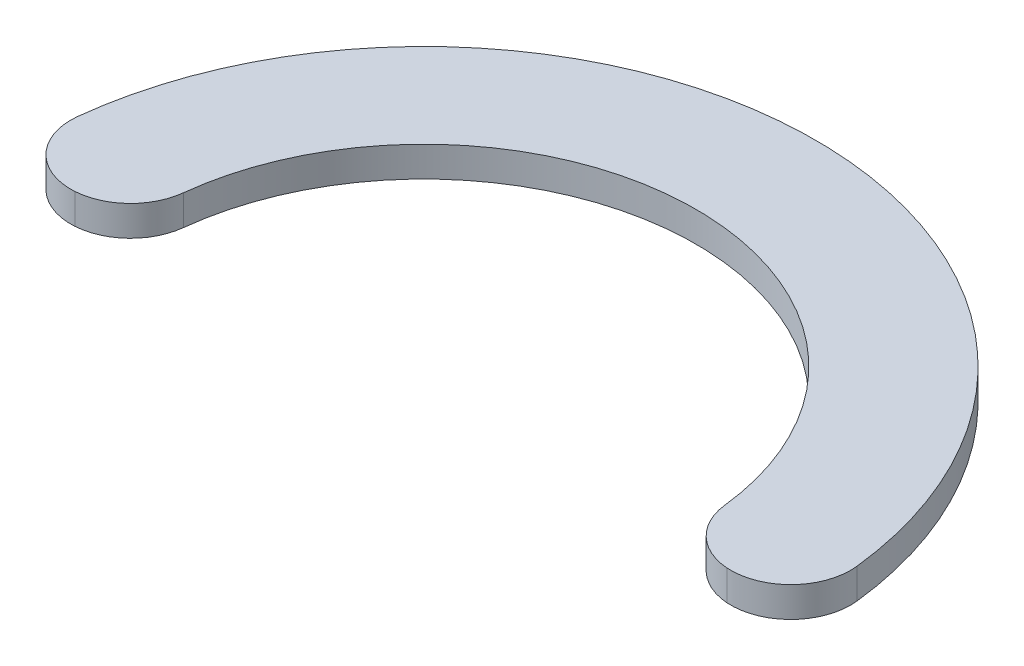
ISO-10303-21;
HEADER;
FILE_DESCRIPTION(('STEP AP214'),'2;1');
FILE_NAME('part.step','',(''),(''),'','','');
FILE_SCHEMA(('AUTOMOTIVE_DESIGN { 1 0 10303 214 1 1 1 1 }'));
ENDSEC;
DATA;
#1=APPLICATION_CONTEXT('core data for automotive mechanical design processes');
#2=APPLICATION_PROTOCOL_DEFINITION('international standard','automotive_design',2000,#1);
#3=PRODUCT_CONTEXT('',#1,'mechanical');
#4=PRODUCT('Part','Part','',(#3));
#5=PRODUCT_RELATED_PRODUCT_CATEGORY('part','',(#4));
#6=PRODUCT_DEFINITION_FORMATION('','',#4);
#7=PRODUCT_DEFINITION_CONTEXT('part definition',#1,'design');
#8=PRODUCT_DEFINITION('design','',#6,#7);
#9=PRODUCT_DEFINITION_SHAPE('','',#8);
#10=(LENGTH_UNIT() NAMED_UNIT(*) SI_UNIT(.MILLI.,.METRE.));
#11=(NAMED_UNIT(*) PLANE_ANGLE_UNIT() SI_UNIT($,.RADIAN.));
#12=(NAMED_UNIT(*) SI_UNIT($,.STERADIAN.) SOLID_ANGLE_UNIT());
#13=UNCERTAINTY_MEASURE_WITH_UNIT(LENGTH_MEASURE(1.E-05),#10,'distance_accuracy_value','');
#14=(GEOMETRIC_REPRESENTATION_CONTEXT(3) GLOBAL_UNCERTAINTY_ASSIGNED_CONTEXT((#13)) GLOBAL_UNIT_ASSIGNED_CONTEXT((#10,
#11,#12)) REPRESENTATION_CONTEXT('',''));
#15=CARTESIAN_POINT('',(0.,0.,0.));
#16=DIRECTION('',(0.,0.,1.));
#17=DIRECTION('',(1.,0.,0.));
#18=AXIS2_PLACEMENT_3D('',#15,#16,#17);
#19=CARTESIAN_POINT('',(0.,4.,0.));
#20=DIRECTION('',(0.,-1.,0.));
#21=DIRECTION('',(0.,0.,-1.));
#22=AXIS2_PLACEMENT_3D('',#19,#20,#21);
#23=CYLINDRICAL_SURFACE('',#22,36.075);
#24=CARTESIAN_POINT('',(0.,0.,0.));
#25=DIRECTION('',(0.,1.,0.));
#26=DIRECTION('',(1.,0.,0.));
#27=AXIS2_PLACEMENT_3D('',#24,#25,#26);
#28=CIRCLE('',#27,36.075);
#29=CARTESIAN_POINT('',(-35.8508829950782,0.,-4.0149487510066));
#30=VERTEX_POINT('',#29);
#31=CARTESIAN_POINT('',(35.8508829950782,0.,-4.01494875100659));
#32=VERTEX_POINT('',#31);
#33=EDGE_CURVE('E107',#30,#32,#28,.F.);
#34=ORIENTED_EDGE('',*,*,#33,.T.);
#35=DIRECTION('',(0.,-1.,0.));
#36=VECTOR('',#35,1.);
#37=CARTESIAN_POINT('',(35.8508829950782,4.,-4.01494875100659));
#38=LINE('',#37,#36);
#39=CARTESIAN_POINT('',(35.8508829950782,4.,-4.01494875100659));
#40=VERTEX_POINT('',#39);
#41=EDGE_CURVE('E11',#32,#40,#38,.F.);
#42=ORIENTED_EDGE('',*,*,#41,.T.);
#43=CARTESIAN_POINT('',(0.,4.,0.));
#44=DIRECTION('',(0.,1.,0.));
#45=DIRECTION('',(1.,0.,0.));
#46=AXIS2_PLACEMENT_3D('',#43,#44,#45);
#47=CIRCLE('',#46,36.075);
#48=CARTESIAN_POINT('',(-35.8508829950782,4.,-4.0149487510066));
#49=VERTEX_POINT('',#48);
#50=EDGE_CURVE('E106',#49,#40,#47,.F.);
#51=ORIENTED_EDGE('',*,*,#50,.F.);
#52=DIRECTION('',(0.,-1.,0.));
#53=VECTOR('',#52,1.);
#54=CARTESIAN_POINT('',(-35.8508829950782,4.,-4.0149487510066));
#55=LINE('',#54,#53);
#56=EDGE_CURVE('E40',#49,#30,#55,.T.);
#57=ORIENTED_EDGE('',*,*,#56,.T.);
#58=EDGE_LOOP('',(#34,#42,#51,#57));
#59=FACE_BOUND('',#58,.T.);
#60=ADVANCED_FACE('F31',(#59),#23,.F.);
#61=CARTESIAN_POINT('',(0.,4.,0.));
#62=DIRECTION('',(0.,-1.,0.));
#63=DIRECTION('',(0.,0.,-1.));
#64=AXIS2_PLACEMENT_3D('',#61,#62,#63);
#65=CYLINDRICAL_SURFACE('',#64,51.925);
#66=CARTESIAN_POINT('',(0.,4.,0.));
#67=DIRECTION('',(0.,1.,0.));
#68=DIRECTION('',(1.,0.,0.));
#69=AXIS2_PLACEMENT_3D('',#66,#67,#68);
#70=CIRCLE('',#69,51.925);
#71=CARTESIAN_POINT('',(-51.6018119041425,4.,-5.78434380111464));
#72=VERTEX_POINT('',#71);
#73=CARTESIAN_POINT('',(51.6018119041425,4.,-5.78434380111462));
#74=VERTEX_POINT('',#73);
#75=EDGE_CURVE('E110',#72,#74,#70,.F.);
#76=ORIENTED_EDGE('',*,*,#75,.T.);
#77=DIRECTION('',(0.,-1.,0.));
#78=VECTOR('',#77,1.);
#79=CARTESIAN_POINT('',(51.6018119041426,4.,-5.78434380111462));
#80=LINE('',#79,#78);
#81=CARTESIAN_POINT('',(51.6018119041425,0.,-5.78434380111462));
#82=VERTEX_POINT('',#81);
#83=EDGE_CURVE('E105',#74,#82,#80,.T.);
#84=ORIENTED_EDGE('',*,*,#83,.T.);
#85=CARTESIAN_POINT('',(0.,0.,0.));
#86=DIRECTION('',(0.,1.,0.));
#87=DIRECTION('',(1.,0.,0.));
#88=AXIS2_PLACEMENT_3D('',#85,#86,#87);
#89=CIRCLE('',#88,51.925);
#90=CARTESIAN_POINT('',(-51.6018119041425,0.,-5.78434380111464));
#91=VERTEX_POINT('',#90);
#92=EDGE_CURVE('E88',#91,#82,#89,.F.);
#93=ORIENTED_EDGE('',*,*,#92,.F.);
#94=DIRECTION('',(0.,-1.,0.));
#95=VECTOR('',#94,1.);
#96=CARTESIAN_POINT('',(-51.6018119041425,4.,-5.78434380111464));
#97=LINE('',#96,#95);
#98=EDGE_CURVE('E103',#91,#72,#97,.F.);
#99=ORIENTED_EDGE('',*,*,#98,.T.);
#100=EDGE_LOOP('',(#76,#84,#93,#99));
#101=FACE_BOUND('',#100,.T.);
#102=ADVANCED_FACE('F102',(#101),#65,.T.);
#103=CARTESIAN_POINT('',(0.,4.,0.));
#104=DIRECTION('',(0.,1.,0.));
#105=DIRECTION('',(0.,0.,1.));
#106=AXIS2_PLACEMENT_3D('',#103,#104,#105);
#107=PLANE('',#106);
#108=CARTESIAN_POINT('',(43.7390710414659,4.,-4.89834877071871));
#109=DIRECTION('',(0.,1.,0.));
#110=DIRECTION('',(0.,0.,1.));
#111=AXIS2_PLACEMENT_3D('',#108,#109,#110);
#112=CIRCLE('',#111,7.9375);
#113=CARTESIAN_POINT('',(43.1727021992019,4.,3.01891922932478));
#114=VERTEX_POINT('',#113);
#115=EDGE_CURVE('E48',#40,#114,#112,.T.);
#116=ORIENTED_EDGE('',*,*,#115,.T.);
#117=CARTESIAN_POINT('',(43.7137159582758,4.,-4.90012177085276));
#118=DIRECTION('',(0.,1.,0.));
#119=DIRECTION('',(0.,0.,1.));
#120=AXIS2_PLACEMENT_3D('',#117,#118,#119);
#121=CIRCLE('',#120,7.9375);
#122=EDGE_CURVE('E124',#114,#74,#121,.T.);
#123=ORIENTED_EDGE('',*,*,#122,.T.);
#124=ORIENTED_EDGE('',*,*,#75,.F.);
#125=CARTESIAN_POINT('',(-43.7137159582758,4.,-4.90012177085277));
#126=DIRECTION('',(0.,1.,0.));
#127=DIRECTION('',(0.,0.,1.));
#128=AXIS2_PLACEMENT_3D('',#125,#126,#127);
#129=CIRCLE('',#128,7.9375);
#130=CARTESIAN_POINT('',(-43.1727021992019,4.,3.01891922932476));
#131=VERTEX_POINT('',#130);
#132=EDGE_CURVE('E55',#72,#131,#129,.T.);
#133=ORIENTED_EDGE('',*,*,#132,.T.);
#134=CARTESIAN_POINT('',(-43.7390710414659,4.,-4.89834877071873));
#135=DIRECTION('',(0.,1.,0.));
#136=DIRECTION('',(0.,0.,1.));
#137=AXIS2_PLACEMENT_3D('',#134,#135,#136);
#138=CIRCLE('',#137,7.9375);
#139=EDGE_CURVE('E120',#131,#49,#138,.T.);
#140=ORIENTED_EDGE('',*,*,#139,.T.);
#141=ORIENTED_EDGE('',*,*,#50,.T.);
#142=EDGE_LOOP('',(#116,#123,#124,#133,#140,#141));
#143=FACE_BOUND('',#142,.T.);
#144=ADVANCED_FACE('F134',(#143),#107,.T.);
#145=CARTESIAN_POINT('',(0.,0.,0.));
#146=DIRECTION('',(0.,1.,0.));
#147=DIRECTION('',(0.,0.,1.));
#148=AXIS2_PLACEMENT_3D('',#145,#146,#147);
#149=PLANE('',#148);
#150=ORIENTED_EDGE('',*,*,#92,.T.);
#151=CARTESIAN_POINT('',(43.7137159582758,0.,-4.90012177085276));
#152=DIRECTION('',(0.,1.,0.));
#153=DIRECTION('',(0.,0.,1.));
#154=AXIS2_PLACEMENT_3D('',#151,#152,#153);
#155=CIRCLE('',#154,7.9375);
#156=CARTESIAN_POINT('',(43.1727021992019,0.,3.01891922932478));
#157=VERTEX_POINT('',#156);
#158=EDGE_CURVE('E118',#82,#157,#155,.F.);
#159=ORIENTED_EDGE('',*,*,#158,.T.);
#160=CARTESIAN_POINT('',(43.7390710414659,0.,-4.89834877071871));
#161=DIRECTION('',(0.,1.,0.));
#162=DIRECTION('',(0.,0.,1.));
#163=AXIS2_PLACEMENT_3D('',#160,#161,#162);
#164=CIRCLE('',#163,7.9375);
#165=EDGE_CURVE('E96',#157,#32,#164,.F.);
#166=ORIENTED_EDGE('',*,*,#165,.T.);
#167=ORIENTED_EDGE('',*,*,#33,.F.);
#168=CARTESIAN_POINT('',(-43.7390710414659,0.,-4.89834877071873));
#169=DIRECTION('',(0.,1.,0.));
#170=DIRECTION('',(0.,0.,1.));
#171=AXIS2_PLACEMENT_3D('',#168,#169,#170);
#172=CIRCLE('',#171,7.9375);
#173=CARTESIAN_POINT('',(-43.1727021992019,0.,3.01891922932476));
#174=VERTEX_POINT('',#173);
#175=EDGE_CURVE('E91',#30,#174,#172,.F.);
#176=ORIENTED_EDGE('',*,*,#175,.T.);
#177=CARTESIAN_POINT('',(-43.7137159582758,0.,-4.90012177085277));
#178=DIRECTION('',(0.,1.,0.));
#179=DIRECTION('',(0.,0.,1.));
#180=AXIS2_PLACEMENT_3D('',#177,#178,#179);
#181=CIRCLE('',#180,7.9375);
#182=EDGE_CURVE('E85',#174,#91,#181,.F.);
#183=ORIENTED_EDGE('',*,*,#182,.T.);
#184=EDGE_LOOP('',(#150,#159,#166,#167,#176,#183));
#185=FACE_BOUND('',#184,.T.);
#186=ADVANCED_FACE('F87',(#185),#149,.F.);
#187=CARTESIAN_POINT('',(43.7390710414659,4.,-4.89834877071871));
#188=DIRECTION('',(0.,-1.,0.));
#189=DIRECTION('',(0.,0.,-1.));
#190=AXIS2_PLACEMENT_3D('',#187,#188,#189);
#191=CYLINDRICAL_SURFACE('',#190,7.9375);
#192=DIRECTION('',(0.,-1.,0.));
#193=VECTOR('',#192,1.);
#194=CARTESIAN_POINT('',(43.1727021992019,2.,3.01891922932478));
#195=LINE('',#194,#193);
#196=EDGE_CURVE('E126',#114,#157,#195,.T.);
#197=ORIENTED_EDGE('',*,*,#196,.F.);
#198=ORIENTED_EDGE('',*,*,#115,.F.);
#199=ORIENTED_EDGE('',*,*,#41,.F.);
#200=ORIENTED_EDGE('',*,*,#165,.F.);
#201=EDGE_LOOP('',(#197,#198,#199,#200));
#202=FACE_BOUND('',#201,.T.);
#203=ADVANCED_FACE('F140',(#202),#191,.T.);
#204=CARTESIAN_POINT('',(43.7137159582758,4.,-4.90012177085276));
#205=DIRECTION('',(0.,-1.,0.));
#206=DIRECTION('',(0.,0.,-1.));
#207=AXIS2_PLACEMENT_3D('',#204,#205,#206);
#208=CYLINDRICAL_SURFACE('',#207,7.9375);
#209=ORIENTED_EDGE('',*,*,#122,.F.);
#210=ORIENTED_EDGE('',*,*,#196,.T.);
#211=ORIENTED_EDGE('',*,*,#158,.F.);
#212=ORIENTED_EDGE('',*,*,#83,.F.);
#213=EDGE_LOOP('',(#209,#210,#211,#212));
#214=FACE_BOUND('',#213,.T.);
#215=ADVANCED_FACE('F141',(#214),#208,.T.);
#216=CARTESIAN_POINT('',(-43.7390710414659,4.,-4.89834877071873));
#217=DIRECTION('',(0.,-1.,0.));
#218=DIRECTION('',(0.,0.,-1.));
#219=AXIS2_PLACEMENT_3D('',#216,#217,#218);
#220=CYLINDRICAL_SURFACE('',#219,7.9375);
#221=ORIENTED_EDGE('',*,*,#56,.F.);
#222=ORIENTED_EDGE('',*,*,#139,.F.);
#223=DIRECTION('',(0.,-1.,0.));
#224=VECTOR('',#223,1.);
#225=CARTESIAN_POINT('',(-43.1727021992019,2.,3.01891922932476));
#226=LINE('',#225,#224);
#227=EDGE_CURVE('E35',#174,#131,#226,.F.);
#228=ORIENTED_EDGE('',*,*,#227,.F.);
#229=ORIENTED_EDGE('',*,*,#175,.F.);
#230=EDGE_LOOP('',(#221,#222,#228,#229));
#231=FACE_BOUND('',#230,.T.);
#232=ADVANCED_FACE('F33',(#231),#220,.T.);
#233=CARTESIAN_POINT('',(-43.7137159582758,4.,-4.90012177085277));
#234=DIRECTION('',(0.,-1.,0.));
#235=DIRECTION('',(0.,0.,-1.));
#236=AXIS2_PLACEMENT_3D('',#233,#234,#235);
#237=CYLINDRICAL_SURFACE('',#236,7.9375);
#238=ORIENTED_EDGE('',*,*,#132,.F.);
#239=ORIENTED_EDGE('',*,*,#98,.F.);
#240=ORIENTED_EDGE('',*,*,#182,.F.);
#241=ORIENTED_EDGE('',*,*,#227,.T.);
#242=EDGE_LOOP('',(#238,#239,#240,#241));
#243=FACE_BOUND('',#242,.T.);
#244=ADVANCED_FACE('F109',(#243),#237,.T.);
#245=CLOSED_SHELL('',(#60,#102,#144,#186,#203,#215,#232,#244));
#246=MANIFOLD_SOLID_BREP('B2',#245);
#247=ADVANCED_BREP_SHAPE_REPRESENTATION('',(#18,#246),#14);
#248=SHAPE_DEFINITION_REPRESENTATION(#9,#247);
ENDSEC;
END-ISO-10303-21;
